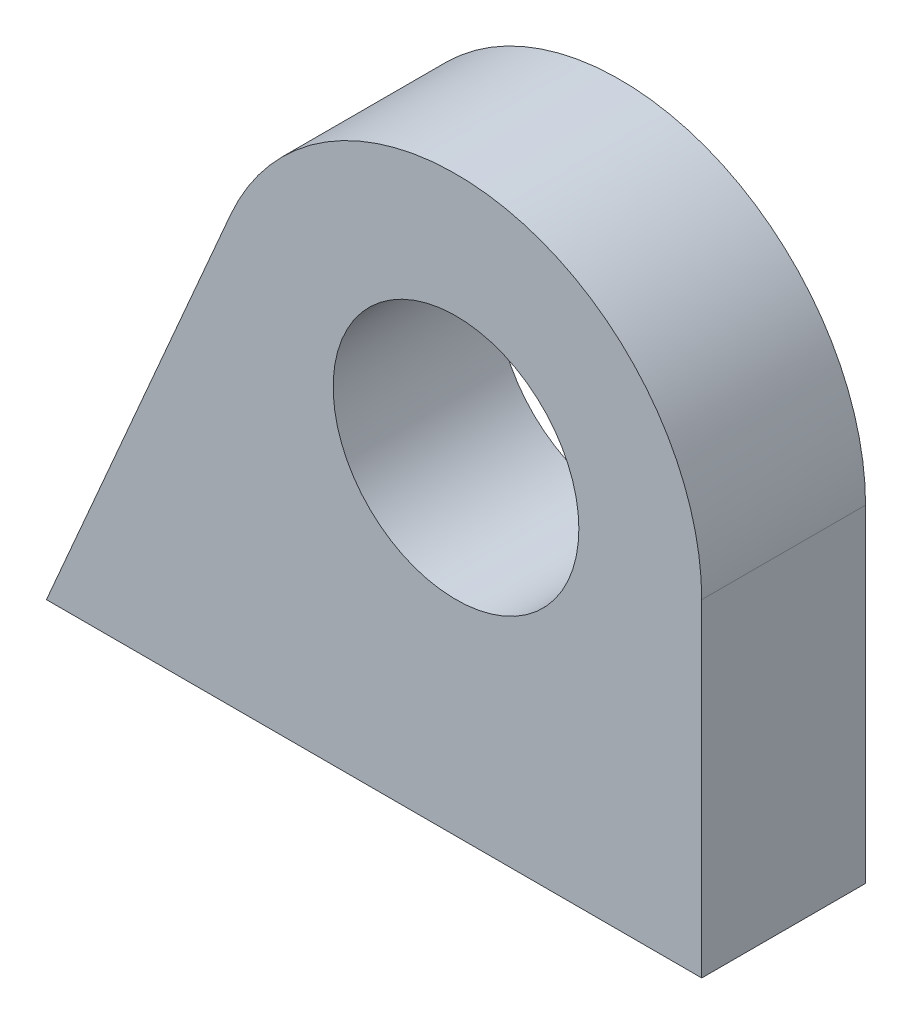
from build123d import *

# Parameters (mm, degrees)
EXTRUSION1_DEPTH      = 5
EXTRUSION1_DEPTH_BACK = 5
ESQUISSE1_R           = 7.5


with BuildPart() as part:
    # Esquisse1 → Extrusion1 (new, two sides: drawn at the far end of the back side and taken through both)
    with BuildSketch(Plane.XY.offset(-EXTRUSION1_DEPTH_BACK)):
        with BuildLine():
            Line((-640, 305), (-600, 305))
            Line((-600, 305), (-600, 325))
            ThreePointArc((-600, 325), (-611.957954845, 339.688293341), (-628.76612817, 330.957660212))
            Line((-628.76612817, 330.957660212), (-640, 305))
        make_face()
        with Locations((-615, 325)):
            Circle(ESQUISSE1_R, mode=Mode.SUBTRACT)
    extrude(amount=EXTRUSION1_DEPTH + EXTRUSION1_DEPTH_BACK)


solid = part.part
